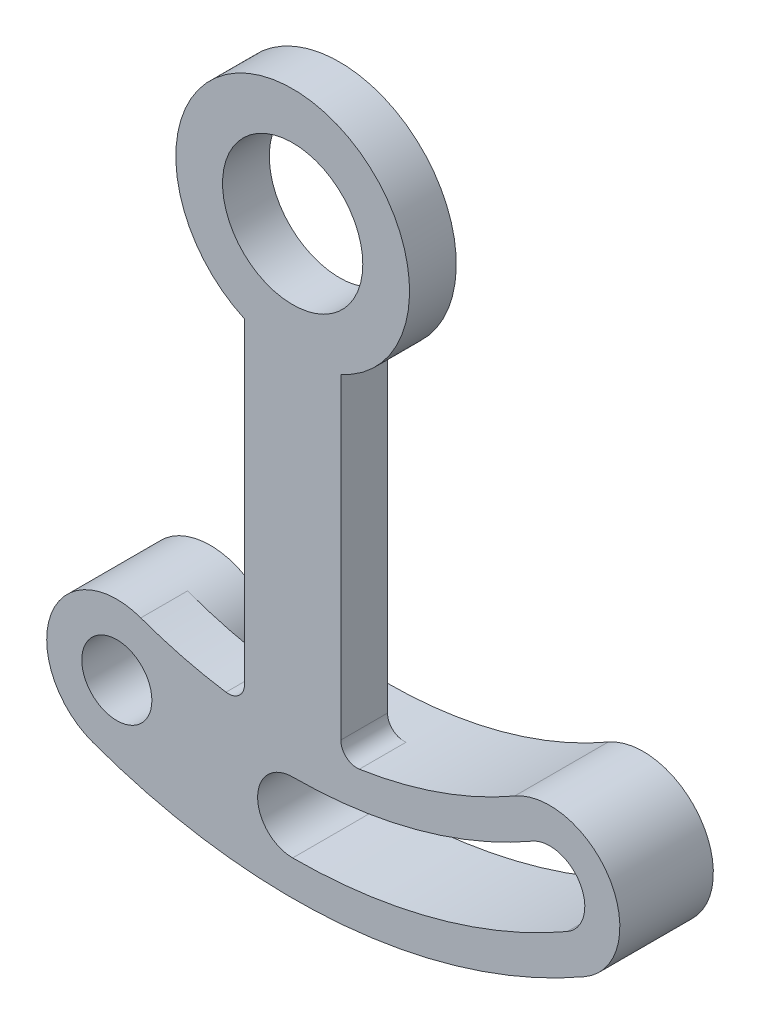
from build123d import *
from build123d.topology import SkipClean

# Parameters (mm, degrees)
SKETCH_1_R      = 3
SKETCH_1_R_2    = 1.5
EXTRUDE_1_DEPTH = 2
EXTRUDE_START   = 2
SKETCH_2_R      = 3
SKETCH_2_R_2    = 1.5
EXTRUDE_2_DEPTH = 2


with BuildPart() as part:
    # Sketch 1 → Extrude 1 (new body)
    with BuildSketch(Plane.XY):
        with BuildLine():
            Line((-2.058968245, -4.556385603), (-2.058968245, -18.101908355))
            ThreePointArc((-2.058968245, -18.101908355), (-2.299353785, -18.625527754), (-2.853133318, -18.784558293))
            ThreePointArc((-2.853133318, -18.784558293), (-4.698842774, -18.409803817), (-6.498382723, -17.854159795))
            ThreePointArc((-6.498382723, -17.854159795), (-10.343521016, -19.647177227), (-8.550503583, -23.49231552))
            ThreePointArc((-8.550503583, -23.49231552), (2.178893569, -24.904867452), (12.5, -21.650635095))
            ThreePointArc((12.5, -21.650635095), (13.598076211, -17.552558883), (9.5, -16.454482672))
            ThreePointArc((9.5, -16.454482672), (6.285482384, -17.930217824), (2.853133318, -18.784558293))
            ThreePointArc((2.853133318, -18.784558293), (2.299353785, -18.625527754), (2.058968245, -18.101908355))
            Line((2.058968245, -18.101908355), (2.058968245, -4.556385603))
            ThreePointArc((2.058968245, -4.556385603), (0, 5), (-2.058968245, -4.556385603))
        make_face()
        Circle(SKETCH_1_R, mode=Mode.SUBTRACT)
        with Locations((-7.524443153, -20.673237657)):
            Circle(SKETCH_1_R_2, mode=Mode.SUBTRACT)
        with BuildLine():
            ThreePointArc((11.75, -20.351596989), (12.299038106, -18.302558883), (10.25, -17.753520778))
            ThreePointArc((10.25, -17.753520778), (5.305790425, -19.801479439), (0, -20.5))
            ThreePointArc((0, -20.5), (-1.5, -22), (0, -23.5))
            ThreePointArc((0, -23.5), (6.08224756, -22.699256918), (11.75, -20.351596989))
        make_face(mode=Mode.SUBTRACT)
    extrude(amount=EXTRUDE_1_DEPTH)

    # Sketch 2 → Extrude 2 (add)
    # profile 1 of 2: a face of its own
    with SkipClean():  # the faces are left unmerged after this step: merging them gives an invalid solid
        with BuildSketch(Plane(origin=(0, 0, 0), x_dir=(-1, 0, 0), z_dir=(0, 0, -1)).offset(EXTRUDE_START)):
            with Locations((7.524443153, -20.673237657)):
                Circle(SKETCH_2_R)
            with Locations((7.524443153, -20.673237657)):
                Circle(SKETCH_2_R_2, mode=Mode.SUBTRACT)
        # profile 2 of 2: a face of its own
        with BuildSketch(Plane(origin=(0, 0, 0), x_dir=(-1, 0, 0), z_dir=(0, 0, -1)).offset(EXTRUDE_START)):
            with BuildLine():
                ThreePointArc((-9.5, -16.454482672), (-13.598076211, -17.552558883), (-12.5, -21.650635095))
                ThreePointArc((-12.5, -21.650635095), (-6.470476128, -24.148145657), (0, -25))
                ThreePointArc((0, -25), (3, -22), (0, -19))
                ThreePointArc((0, -19), (-4.917561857, -18.352590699), (-9.5, -16.454482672))
            make_face()
            with BuildLine():
                ThreePointArc((-10.25, -17.753520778), (-12.299038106, -18.302558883), (-11.75, -20.351596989))
                ThreePointArc((-11.75, -20.351596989), (-6.08224756, -22.699256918), (0, -23.5))
                ThreePointArc((0, -23.5), (1.5, -22), (0, -20.5))
                ThreePointArc((0, -20.5), (-5.305790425, -19.801479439), (-10.25, -17.753520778))
            make_face(mode=Mode.SUBTRACT)
        extrude(amount=-EXTRUDE_2_DEPTH)


solid = part.part
